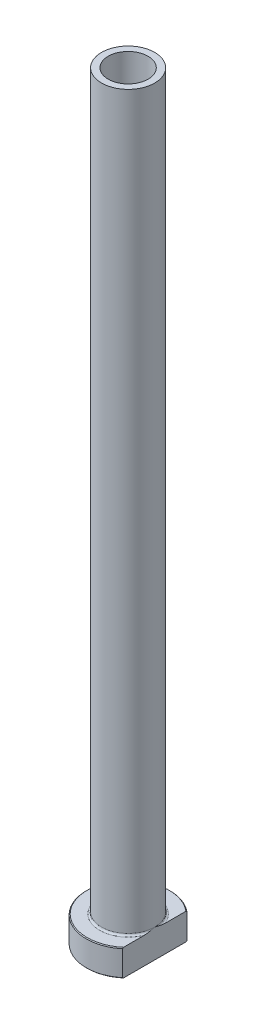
ISO-10303-21;
HEADER;
FILE_DESCRIPTION(('STEP AP214'),'2;1');
FILE_NAME('part.step','',(''),(''),'','','');
FILE_SCHEMA(('AUTOMOTIVE_DESIGN { 1 0 10303 214 1 1 1 1 }'));
ENDSEC;
DATA;
#1=APPLICATION_CONTEXT('core data for automotive mechanical design processes');
#2=APPLICATION_PROTOCOL_DEFINITION('international standard','automotive_design',2000,#1);
#3=PRODUCT_CONTEXT('',#1,'mechanical');
#4=PRODUCT('Part','Part','',(#3));
#5=PRODUCT_RELATED_PRODUCT_CATEGORY('part','',(#4));
#6=PRODUCT_DEFINITION_FORMATION('','',#4);
#7=PRODUCT_DEFINITION_CONTEXT('part definition',#1,'design');
#8=PRODUCT_DEFINITION('design','',#6,#7);
#9=PRODUCT_DEFINITION_SHAPE('','',#8);
#10=(LENGTH_UNIT() NAMED_UNIT(*) SI_UNIT(.MILLI.,.METRE.));
#11=(NAMED_UNIT(*) PLANE_ANGLE_UNIT() SI_UNIT($,.RADIAN.));
#12=(NAMED_UNIT(*) SI_UNIT($,.STERADIAN.) SOLID_ANGLE_UNIT());
#13=UNCERTAINTY_MEASURE_WITH_UNIT(LENGTH_MEASURE(1.E-05),#10,'distance_accuracy_value','');
#14=(GEOMETRIC_REPRESENTATION_CONTEXT(3) GLOBAL_UNCERTAINTY_ASSIGNED_CONTEXT((#13)) GLOBAL_UNIT_ASSIGNED_CONTEXT((#10,
#11,#12)) REPRESENTATION_CONTEXT('',''));
#15=CARTESIAN_POINT('',(0.,0.,0.));
#16=DIRECTION('',(0.,0.,1.));
#17=DIRECTION('',(1.,0.,0.));
#18=AXIS2_PLACEMENT_3D('',#15,#16,#17);
#19=CARTESIAN_POINT('',(0.,92.1876809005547,0.));
#20=DIRECTION('',(0.,1.,0.));
#21=DIRECTION('',(0.,0.,1.));
#22=AXIS2_PLACEMENT_3D('',#19,#20,#21);
#23=CYLINDRICAL_SURFACE('',#22,5.25);
#24=CARTESIAN_POINT('',(0.,200.,0.));
#25=DIRECTION('',(0.,1.,0.));
#26=DIRECTION('',(0.,0.,1.));
#27=AXIS2_PLACEMENT_3D('',#24,#25,#26);
#28=CIRCLE('',#27,5.25);
#29=CARTESIAN_POINT('',(0.,200.,5.25));
#30=VERTEX_POINT('',#29);
#31=EDGE_CURVE('E167',#30,#30,#28,.T.);
#32=ORIENTED_EDGE('',*,*,#31,.T.);
#33=EDGE_LOOP('',(#32));
#34=FACE_BOUND('',#33,.T.);
#35=CARTESIAN_POINT('',(0.,145.,0.));
#36=DIRECTION('',(0.,1.,0.));
#37=DIRECTION('',(0.,0.,1.));
#38=AXIS2_PLACEMENT_3D('',#35,#36,#37);
#39=CIRCLE('',#38,5.25);
#40=CARTESIAN_POINT('',(0.,145.,5.25));
#41=VERTEX_POINT('',#40);
#42=EDGE_CURVE('E170',#41,#41,#39,.T.);
#43=ORIENTED_EDGE('',*,*,#42,.F.);
#44=EDGE_LOOP('',(#43));
#45=FACE_BOUND('',#44,.T.);
#46=ADVANCED_FACE('F32',(#34,#45),#23,.F.);
#47=CARTESIAN_POINT('',(-5.25,200.,0.));
#48=DIRECTION('',(0.,1.,0.));
#49=DIRECTION('',(0.,0.,1.));
#50=AXIS2_PLACEMENT_3D('',#47,#48,#49);
#51=PLANE('',#50);
#52=CARTESIAN_POINT('',(0.,200.,0.));
#53=DIRECTION('',(0.,1.,0.));
#54=DIRECTION('',(0.,0.,1.));
#55=AXIS2_PLACEMENT_3D('',#52,#53,#54);
#56=CIRCLE('',#55,7.00000000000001);
#57=CARTESIAN_POINT('',(0.,200.,7.00000000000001));
#58=VERTEX_POINT('',#57);
#59=EDGE_CURVE('E174',#58,#58,#56,.T.);
#60=ORIENTED_EDGE('',*,*,#59,.T.);
#61=EDGE_LOOP('',(#60));
#62=FACE_BOUND('',#61,.T.);
#63=ORIENTED_EDGE('',*,*,#31,.F.);
#64=EDGE_LOOP('',(#63));
#65=FACE_BOUND('',#64,.T.);
#66=ADVANCED_FACE('F157',(#62,#65),#51,.T.);
#67=CARTESIAN_POINT('',(0.,92.1876809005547,0.));
#68=DIRECTION('',(0.,1.,0.));
#69=DIRECTION('',(0.,0.,1.));
#70=AXIS2_PLACEMENT_3D('',#67,#68,#69);
#71=CYLINDRICAL_SURFACE('',#70,7.);
#72=CARTESIAN_POINT('',(0.,7.50000000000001,0.));
#73=DIRECTION('',(0.,1.,0.));
#74=DIRECTION('',(0.,0.,1.));
#75=AXIS2_PLACEMENT_3D('',#72,#73,#74);
#76=CIRCLE('',#75,7.);
#77=CARTESIAN_POINT('',(7.,7.50000000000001,0.));
#78=VERTEX_POINT('',#77);
#79=EDGE_CURVE('E180',#78,#78,#76,.T.);
#80=ORIENTED_EDGE('',*,*,#79,.T.);
#81=EDGE_LOOP('',(#80));
#82=FACE_BOUND('',#81,.T.);
#83=ORIENTED_EDGE('',*,*,#59,.F.);
#84=EDGE_LOOP('',(#83));
#85=FACE_BOUND('',#84,.T.);
#86=ADVANCED_FACE('F162',(#82,#85),#71,.T.);
#87=CARTESIAN_POINT('',(-6.99999999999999,7.,0.));
#88=DIRECTION('',(0.,1.,0.));
#89=DIRECTION('',(0.,0.,1.));
#90=AXIS2_PLACEMENT_3D('',#87,#88,#89);
#91=PLANE('',#90);
#92=DIRECTION('',(0.,0.,1.));
#93=VECTOR('',#92,1.);
#94=CARTESIAN_POINT('',(6.99999999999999,7.,0.));
#95=LINE('',#94,#93);
#96=CARTESIAN_POINT('',(7.,7.,-8.22435407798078));
#97=VERTEX_POINT('',#96);
#98=CARTESIAN_POINT('',(6.99999999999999,7.,-2.69258240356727));
#99=VERTEX_POINT('',#98);
#100=EDGE_CURVE('E54',#97,#99,#95,.T.);
#101=ORIENTED_EDGE('',*,*,#100,.F.);
#102=CARTESIAN_POINT('',(0.,7.,0.));
#103=DIRECTION('',(0.,1.,0.));
#104=DIRECTION('',(0.,0.,1.));
#105=AXIS2_PLACEMENT_3D('',#102,#103,#104);
#106=CIRCLE('',#105,10.8);
#107=CARTESIAN_POINT('',(6.99999999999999,7.,8.22435407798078));
#108=VERTEX_POINT('',#107);
#109=EDGE_CURVE('E186',#97,#108,#106,.T.);
#110=ORIENTED_EDGE('',*,*,#109,.T.);
#111=CARTESIAN_POINT('',(6.99999999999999,7.,2.69258240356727));
#112=VERTEX_POINT('',#111);
#113=EDGE_CURVE('E134',#112,#108,#95,.T.);
#114=ORIENTED_EDGE('',*,*,#113,.F.);
#115=CARTESIAN_POINT('',(0.,7.,0.));
#116=DIRECTION('',(0.,1.,0.));
#117=DIRECTION('',(0.,0.,1.));
#118=AXIS2_PLACEMENT_3D('',#115,#116,#117);
#119=CIRCLE('',#118,7.5);
#120=EDGE_CURVE('E183',#112,#99,#119,.F.);
#121=ORIENTED_EDGE('',*,*,#120,.T.);
#122=EDGE_LOOP('',(#101,#110,#114,#121));
#123=FACE_BOUND('',#122,.T.);
#124=ADVANCED_FACE('F197',(#123),#91,.T.);
#125=CARTESIAN_POINT('',(0.,92.1876809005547,0.));
#126=DIRECTION('',(0.,1.,0.));
#127=DIRECTION('',(0.,0.,1.));
#128=AXIS2_PLACEMENT_3D('',#125,#126,#127);
#129=CYLINDRICAL_SURFACE('',#128,11.);
#130=DIRECTION('',(0.,-1.,0.));
#131=VECTOR('',#130,1.);
#132=CARTESIAN_POINT('',(6.99999999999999,200.,8.48528137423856));
#133=LINE('',#132,#131);
#134=CARTESIAN_POINT('',(6.99999999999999,6.79999999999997,8.48528137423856));
#135=VERTEX_POINT('',#134);
#136=CARTESIAN_POINT('',(6.99999999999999,0.200000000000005,8.48528137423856));
#137=VERTEX_POINT('',#136);
#138=EDGE_CURVE('E82',#135,#137,#133,.T.);
#139=ORIENTED_EDGE('',*,*,#138,.F.);
#140=CARTESIAN_POINT('',(0.,6.79999999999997,0.));
#141=DIRECTION('',(0.,1.,0.));
#142=DIRECTION('',(0.,0.,1.));
#143=AXIS2_PLACEMENT_3D('',#140,#141,#142);
#144=CIRCLE('',#143,11.);
#145=CARTESIAN_POINT('',(7.,6.79999999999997,-8.48528137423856));
#146=VERTEX_POINT('',#145);
#147=EDGE_CURVE('E95',#135,#146,#144,.F.);
#148=ORIENTED_EDGE('',*,*,#147,.T.);
#149=DIRECTION('',(0.,-1.,0.));
#150=VECTOR('',#149,1.);
#151=CARTESIAN_POINT('',(7.,200.,-8.48528137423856));
#152=LINE('',#151,#150);
#153=CARTESIAN_POINT('',(7.,0.200000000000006,-8.48528137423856));
#154=VERTEX_POINT('',#153);
#155=EDGE_CURVE('E192',#146,#154,#152,.T.);
#156=ORIENTED_EDGE('',*,*,#155,.T.);
#157=CARTESIAN_POINT('',(0.,0.200000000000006,0.));
#158=DIRECTION('',(0.,-1.,0.));
#159=DIRECTION('',(0.,0.,-1.));
#160=AXIS2_PLACEMENT_3D('',#157,#158,#159);
#161=CIRCLE('',#160,11.);
#162=EDGE_CURVE('E98',#154,#137,#161,.F.);
#163=ORIENTED_EDGE('',*,*,#162,.T.);
#164=EDGE_LOOP('',(#139,#148,#156,#163));
#165=FACE_BOUND('',#164,.T.);
#166=ADVANCED_FACE('F190',(#165),#129,.T.);
#167=CARTESIAN_POINT('',(-11.,0.,0.));
#168=DIRECTION('',(0.,-1.,0.));
#169=DIRECTION('',(0.,0.,-1.));
#170=AXIS2_PLACEMENT_3D('',#167,#168,#169);
#171=PLANE('',#170);
#172=CARTESIAN_POINT('',(0.,0.,0.));
#173=DIRECTION('',(0.,-1.,0.));
#174=DIRECTION('',(0.,0.,-1.));
#175=AXIS2_PLACEMENT_3D('',#172,#173,#174);
#176=CIRCLE('',#175,6.00000000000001);
#177=CARTESIAN_POINT('',(0.,0.,-6.00000000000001));
#178=VERTEX_POINT('',#177);
#179=EDGE_CURVE('E40',#178,#178,#176,.F.);
#180=ORIENTED_EDGE('',*,*,#179,.T.);
#181=EDGE_LOOP('',(#180));
#182=FACE_BOUND('',#181,.T.);
#183=DIRECTION('',(0.,0.,-1.));
#184=VECTOR('',#183,1.);
#185=CARTESIAN_POINT('',(6.99999999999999,0.,8.48528137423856));
#186=LINE('',#185,#184);
#187=CARTESIAN_POINT('',(6.99999999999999,0.,8.22435407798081));
#188=VERTEX_POINT('',#187);
#189=CARTESIAN_POINT('',(7.,0.,-8.22435407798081));
#190=VERTEX_POINT('',#189);
#191=EDGE_CURVE('E47',#188,#190,#186,.T.);
#192=ORIENTED_EDGE('',*,*,#191,.F.);
#193=CARTESIAN_POINT('',(0.,0.,0.));
#194=DIRECTION('',(0.,-1.,0.));
#195=DIRECTION('',(0.,0.,-1.));
#196=AXIS2_PLACEMENT_3D('',#193,#194,#195);
#197=CIRCLE('',#196,10.8);
#198=EDGE_CURVE('E92',#188,#190,#197,.T.);
#199=ORIENTED_EDGE('',*,*,#198,.T.);
#200=EDGE_LOOP('',(#192,#199));
#201=FACE_BOUND('',#200,.T.);
#202=ADVANCED_FACE('F91',(#182,#201),#171,.T.);
#203=CARTESIAN_POINT('',(0.,92.1876809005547,0.));
#204=DIRECTION('',(0.,1.,0.));
#205=DIRECTION('',(0.,0.,1.));
#206=AXIS2_PLACEMENT_3D('',#203,#204,#205);
#207=CYLINDRICAL_SURFACE('',#206,5.5);
#208=CARTESIAN_POINT('',(0.,0.500000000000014,0.));
#209=DIRECTION('',(0.,-1.,0.));
#210=DIRECTION('',(0.,0.,-1.));
#211=AXIS2_PLACEMENT_3D('',#208,#209,#210);
#212=CIRCLE('',#211,5.5);
#213=CARTESIAN_POINT('',(0.,0.500000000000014,-5.5));
#214=VERTEX_POINT('',#213);
#215=EDGE_CURVE('E11',#214,#214,#212,.T.);
#216=ORIENTED_EDGE('',*,*,#215,.T.);
#217=EDGE_LOOP('',(#216));
#218=FACE_BOUND('',#217,.T.);
#219=CARTESIAN_POINT('',(0.,133.,0.));
#220=DIRECTION('',(0.,1.,0.));
#221=DIRECTION('',(0.,0.,1.));
#222=AXIS2_PLACEMENT_3D('',#219,#220,#221);
#223=CIRCLE('',#222,5.50000000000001);
#224=CARTESIAN_POINT('',(0.,133.,5.50000000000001));
#225=VERTEX_POINT('',#224);
#226=EDGE_CURVE('E172',#225,#225,#223,.T.);
#227=ORIENTED_EDGE('',*,*,#226,.T.);
#228=EDGE_LOOP('',(#227));
#229=FACE_BOUND('',#228,.T.);
#230=ADVANCED_FACE('F215',(#218,#229),#207,.F.);
#231=CARTESIAN_POINT('',(0.,133.,0.));
#232=DIRECTION('',(0.,-1.,0.));
#233=DIRECTION('',(0.,0.,-1.));
#234=AXIS2_PLACEMENT_3D('',#231,#232,#233);
#235=CONICAL_SURFACE('',#234,5.50000000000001,0.0208303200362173);
#236=ORIENTED_EDGE('',*,*,#42,.T.);
#237=EDGE_LOOP('',(#236));
#238=FACE_BOUND('',#237,.T.);
#239=ORIENTED_EDGE('',*,*,#226,.F.);
#240=EDGE_LOOP('',(#239));
#241=FACE_BOUND('',#240,.T.);
#242=ADVANCED_FACE('F111',(#238,#241),#235,.F.);
#243=CARTESIAN_POINT('',(0.,7.50000000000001,0.));
#244=DIRECTION('',(0.,1.,0.));
#245=DIRECTION('',(0.,0.,1.));
#246=AXIS2_PLACEMENT_3D('',#243,#244,#245);
#247=TOROIDAL_SURFACE('',#246,7.5,0.5);
#248=ORIENTED_EDGE('',*,*,#120,.F.);
#249=CARTESIAN_POINT('',(7.,7.50000000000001,0.));
#250=CARTESIAN_POINT('',(7.,7.50000080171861,-1.25567824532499E-10));
#251=CARTESIAN_POINT('',(7.,7.50000160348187,2.90220328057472E-07));
#252=CARTESIAN_POINT('',(7.,7.50000310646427,1.10846453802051E-06));
#253=CARTESIAN_POINT('',(7.,7.50000379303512,1.65470126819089E-06));
#254=CARTESIAN_POINT('',(7.,7.50000521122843,2.96102774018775E-06));
#255=CARTESIAN_POINT('',(7.,7.5000059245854,3.7420420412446E-06));
#256=CARTESIAN_POINT('',(7.,7.50000721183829,5.36891904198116E-06));
#257=CARTESIAN_POINT('',(7.,7.5000077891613,6.21226373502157E-06));
#258=CARTESIAN_POINT('',(7.,7.5000099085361,9.448897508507E-06));
#259=CARTESIAN_POINT('',(7.,7.50001133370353,1.19224919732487E-05));
#260=CARTESIAN_POINT('',(7.,7.50001370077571,1.68453055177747E-05));
#261=CARTESIAN_POINT('',(7.,7.50001467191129,1.92810868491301E-05));
#262=CARTESIAN_POINT('',(7.,7.50001870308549,2.95057535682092E-05));
#263=CARTESIAN_POINT('',(7.,7.50002167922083,3.7333383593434E-05));
#264=CARTESIAN_POINT('',(7.,7.50002610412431,5.21820430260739E-05));
#265=CARTESIAN_POINT('',(7.,7.50002771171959,5.91556029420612E-05));
#266=CARTESIAN_POINT('',(7.,7.50003935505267,0.000110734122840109));
#267=CARTESIAN_POINT('',(7.,7.5000481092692,0.000155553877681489));
#268=CARTESIAN_POINT('',(6.99999999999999,7.50008643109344,0.000332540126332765));
#269=CARTESIAN_POINT('',(6.99999999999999,7.50012307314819,0.000463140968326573));
#270=CARTESIAN_POINT('',(7.,7.50026565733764,0.000980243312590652));
#271=CARTESIAN_POINT('',(7.,7.50036696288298,0.00136762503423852));
#272=CARTESIAN_POINT('',(6.99999999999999,7.50077257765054,0.00290683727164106));
#273=CARTESIAN_POINT('',(6.99999999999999,7.50108269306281,0.00405753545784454));
#274=CARTESIAN_POINT('',(7.00000000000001,7.50237341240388,0.00885983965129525));
#275=CARTESIAN_POINT('',(7.,7.50334676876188,0.0125128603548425));
#276=CARTESIAN_POINT('',(6.99999999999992,7.51627189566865,0.061003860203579));
#277=CARTESIAN_POINT('',(6.99999999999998,7.52827280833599,0.105832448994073));
#278=CARTESIAN_POINT('',(7.00000000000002,7.55170994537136,0.193693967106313));
#279=CARTESIAN_POINT('',(7.,7.56314936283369,0.236726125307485));
#280=CARTESIAN_POINT('',(6.99999999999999,7.58740418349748,0.328321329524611));
#281=CARTESIAN_POINT('',(6.99999999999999,7.6002083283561,0.376887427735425));
#282=CARTESIAN_POINT('',(7.,7.62578161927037,0.474605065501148));
#283=CARTESIAN_POINT('',(7.,7.63854879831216,0.523757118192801));
#284=CARTESIAN_POINT('',(6.99999999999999,7.66904753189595,0.64236612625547));
#285=CARTESIAN_POINT('',(7.,7.6866596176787,0.711854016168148));
#286=CARTESIAN_POINT('',(7.,7.72074501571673,0.849103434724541));
#287=CARTESIAN_POINT('',(7.,7.73723627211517,0.916860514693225));
#288=CARTESIAN_POINT('',(7.,7.79038156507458,1.14104210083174));
#289=CARTESIAN_POINT('',(7.,7.82528973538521,1.29788860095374));
#290=CARTESIAN_POINT('',(7.,7.88862298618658,1.61471917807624));
#291=CARTESIAN_POINT('',(7.,7.91697354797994,1.77471883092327));
#292=CARTESIAN_POINT('',(7.,7.95258292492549,2.02253505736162));
#293=CARTESIAN_POINT('',(7.,7.96355251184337,2.10981398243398));
#294=CARTESIAN_POINT('',(7.,7.98165287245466,2.28476193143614));
#295=CARTESIAN_POINT('',(7.,7.98878459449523,2.37243085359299));
#296=CARTESIAN_POINT('',(7.,7.99822919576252,2.54760327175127));
#297=CARTESIAN_POINT('',(7.,8.00056589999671,2.63510541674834));
#298=CARTESIAN_POINT('',(7.,7.99919996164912,2.81004074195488));
#299=CARTESIAN_POINT('',(7.,7.99550272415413,2.89747391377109));
#300=CARTESIAN_POINT('',(7.,7.98391011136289,3.02882076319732));
#301=CARTESIAN_POINT('',(7.,7.97897237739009,3.07299684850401));
#302=CARTESIAN_POINT('',(7.,7.96665453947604,3.16105400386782));
#303=CARTESIAN_POINT('',(7.,7.95927246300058,3.20493480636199));
#304=CARTESIAN_POINT('',(7.,7.94168688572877,3.29163191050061));
#305=CARTESIAN_POINT('',(7.,7.93151559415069,3.33445462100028));
#306=CARTESIAN_POINT('',(7.,7.90768392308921,3.41909658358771));
#307=CARTESIAN_POINT('',(7.,7.89402748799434,3.46091691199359));
#308=CARTESIAN_POINT('',(7.,7.86214701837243,3.54331777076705));
#309=CARTESIAN_POINT('',(7.,7.84387618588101,3.58388050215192));
#310=CARTESIAN_POINT('',(7.,7.80145892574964,3.66184445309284));
#311=CARTESIAN_POINT('',(7.,7.77733569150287,3.69925738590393));
#312=CARTESIAN_POINT('',(7.,7.73714014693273,3.74836513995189));
#313=CARTESIAN_POINT('',(7.,7.72423208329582,3.76263695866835));
#314=CARTESIAN_POINT('',(7.,7.69673765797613,3.78951670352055));
#315=CARTESIAN_POINT('',(7.,7.68215013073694,3.80212346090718));
#316=CARTESIAN_POINT('',(7.,7.65099843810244,3.82514624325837));
#317=CARTESIAN_POINT('',(7.,7.63441049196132,3.83553078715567));
#318=CARTESIAN_POINT('',(7.,7.59955798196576,3.85294010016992));
#319=CARTESIAN_POINT('',(7.,7.58129885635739,3.85997533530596));
#320=CARTESIAN_POINT('',(7.,7.54906837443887,3.86837810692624));
#321=CARTESIAN_POINT('',(7.,7.53536870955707,3.87079233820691));
#322=CARTESIAN_POINT('',(7.,7.50775756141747,3.87325240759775));
#323=CARTESIAN_POINT('',(7.,7.49384618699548,3.87329942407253));
#324=CARTESIAN_POINT('',(7.,7.46623771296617,3.87102093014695));
#325=CARTESIAN_POINT('',(7.,7.45254041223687,3.8686978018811));
#326=CARTESIAN_POINT('',(7.,7.42569741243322,3.86188775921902));
#327=CARTESIAN_POINT('',(7.,7.41255212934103,3.85739924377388));
#328=CARTESIAN_POINT('',(7.,7.38259319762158,3.84468786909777));
#329=CARTESIAN_POINT('',(7.,7.36610215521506,3.83570823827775));
#330=CARTESIAN_POINT('',(7.,7.33476729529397,3.8152320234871));
#331=CARTESIAN_POINT('',(7.,7.3199273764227,3.80372966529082));
#332=CARTESIAN_POINT('',(7.,7.2837192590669,3.77170797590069));
#333=CARTESIAN_POINT('',(7.,7.2635627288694,3.74983059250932));
#334=CARTESIAN_POINT('',(7.,7.22671696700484,3.70338283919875));
#335=CARTESIAN_POINT('',(7.,7.21003361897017,3.67880800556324));
#336=CARTESIAN_POINT('',(7.,7.18026553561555,3.62921731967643));
#337=CARTESIAN_POINT('',(7.,7.16704475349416,3.60428175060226));
#338=CARTESIAN_POINT('',(7.,7.14275069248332,3.55337478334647));
#339=CARTESIAN_POINT('',(7.,7.13167947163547,3.52740242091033));
#340=CARTESIAN_POINT('',(7.,7.1010449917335,3.4480957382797));
#341=CARTESIAN_POINT('',(7.,7.08424174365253,3.39369851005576));
#342=CARTESIAN_POINT('',(7.,7.0543137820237,3.27667221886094));
#343=CARTESIAN_POINT('',(7.,7.04191718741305,3.21386807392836));
#344=CARTESIAN_POINT('',(7.,7.02234605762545,3.08735184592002));
#345=CARTESIAN_POINT('',(7.,7.01518234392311,3.02363815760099));
#346=CARTESIAN_POINT('',(7.,7.00517826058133,2.89779001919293));
#347=CARTESIAN_POINT('',(7.,7.00221627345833,2.83566460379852));
#348=CARTESIAN_POINT('',(7.,6.99952325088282,2.71160626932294));
#349=CARTESIAN_POINT('',(7.,6.99977918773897,2.64967358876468));
#350=CARTESIAN_POINT('',(7.,7.00377761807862,2.49407814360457));
#351=CARTESIAN_POINT('',(7.,7.00924384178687,2.40046113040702));
#352=CARTESIAN_POINT('',(7.,7.02494106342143,2.21367396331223));
#353=CARTESIAN_POINT('',(7.,7.03517106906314,2.12050372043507));
#354=CARTESIAN_POINT('',(7.,7.05969765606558,1.9324903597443));
#355=CARTESIAN_POINT('',(7.,7.07408383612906,1.83765914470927));
#356=CARTESIAN_POINT('',(7.,7.10603300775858,1.64829340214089));
#357=CARTESIAN_POINT('',(7.,7.12360402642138,1.55376025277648));
#358=CARTESIAN_POINT('',(7.,7.16806468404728,1.33086107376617));
#359=CARTESIAN_POINT('',(7.,7.19601783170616,1.2027089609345));
#360=CARTESIAN_POINT('',(7.,7.25475947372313,0.948586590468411));
#361=CARTESIAN_POINT('',(7.,7.28551257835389,0.822607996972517));
#362=CARTESIAN_POINT('',(7.,7.33123897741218,0.641334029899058));
#363=CARTESIAN_POINT('',(7.,7.34543722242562,0.585840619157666));
#364=CARTESIAN_POINT('',(6.99999999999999,7.3741824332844,0.474686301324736));
#365=CARTESIAN_POINT('',(6.99999999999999,7.38873064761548,0.419025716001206));
#366=CARTESIAN_POINT('',(7.,7.41873357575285,0.305011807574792));
#367=CARTESIAN_POINT('',(7.,7.43419762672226,0.246660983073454));
#368=CARTESIAN_POINT('',(6.99999999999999,7.46502361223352,0.130933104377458));
#369=CARTESIAN_POINT('',(6.99999999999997,7.48038319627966,0.0735554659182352));
#370=CARTESIAN_POINT('',(7.,7.49665455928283,0.0125077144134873));
#371=CARTESIAN_POINT('',(7.,7.49762931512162,0.00884956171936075));
#372=CARTESIAN_POINT('',(6.99999999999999,7.49892036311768,0.00404608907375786));
#373=CARTESIAN_POINT('',(6.99999999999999,7.49922940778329,0.00289935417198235));
#374=CARTESIAN_POINT('',(7.,7.49963371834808,0.00136508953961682));
#375=CARTESIAN_POINT('',(7.,7.4997347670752,0.000978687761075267));
#376=CARTESIAN_POINT('',(6.99999999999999,7.49987704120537,0.000462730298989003));
#377=CARTESIAN_POINT('',(6.99999999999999,7.49991363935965,0.000332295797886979));
#378=CARTESIAN_POINT('',(7.,7.4999519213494,0.000155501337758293));
#379=CARTESIAN_POINT('',(7.,7.49996067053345,0.000110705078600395));
#380=CARTESIAN_POINT('',(7.,7.49997230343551,5.91504880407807E-05));
#381=CARTESIAN_POINT('',(7.,7.49997390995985,5.21782486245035E-05));
#382=CARTESIAN_POINT('',(7.,7.49997833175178,3.73322829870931E-05));
#383=CARTESIAN_POINT('',(7.,7.49998130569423,2.95059561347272E-05));
#384=CARTESIAN_POINT('',(7.,7.49998533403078,1.92826360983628E-05));
#385=CARTESIAN_POINT('',(7.,7.49998630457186,1.68469535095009E-05));
#386=CARTESIAN_POINT('',(7.,7.49998867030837,1.19242382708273E-05));
#387=CARTESIAN_POINT('',(7.,7.49999009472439,9.45063129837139E-06));
#388=CARTESIAN_POINT('',(7.,7.49999221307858,6.21386495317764E-06));
#389=CARTESIAN_POINT('',(7.,7.4999927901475,5.37045357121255E-06));
#390=CARTESIAN_POINT('',(7.,7.49999407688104,3.74339732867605E-06));
#391=CARTESIAN_POINT('',(7.,7.49999478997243,2.96226892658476E-06));
#392=CARTESIAN_POINT('',(7.,7.49999620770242,1.65567368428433E-06));
#393=CARTESIAN_POINT('',(7.,7.4999968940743,1.10929212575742E-06));
#394=CARTESIAN_POINT('',(7.,7.49999839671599,2.90683261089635E-07));
#395=CARTESIAN_POINT('',(7.,7.49999919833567,1.25560755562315E-10));
#396=CARTESIAN_POINT('',(7.,7.50000000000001,0.));
#397=B_SPLINE_CURVE_WITH_KNOTS('',3,(#249,#250,#251,#252,#253,#254,#255,#256,#257,#258,#259,
#260,#261,#262,#263,#264,#265,#266,#267,#268,#269,#270,#271,#272,#273,#274,#275,#276,#277,#278,
#279,#280,#281,#282,#283,#284,#285,#286,#287,#288,#289,#290,#291,#292,#293,#294,#295,#296,#297,
#298,#299,#300,#301,#302,#303,#304,#305,#306,#307,#308,#309,#310,#311,#312,#313,#314,#315,#316,
#317,#318,#319,#320,#321,#322,#323,#324,#325,#326,#327,#328,#329,#330,#331,#332,#333,#334,#335,
#336,#337,#338,#339,#340,#341,#342,#343,#344,#345,#346,#347,#348,#349,#350,#351,#352,#353,#354,
#355,#356,#357,#358,#359,#360,#361,#362,#363,#364,#365,#366,#367,#368,#369,#370,#371,#372,#373,
#374,#375,#376,#377,#378,#379,#380,#381,#382,#383,#384,#385,#386,#387,#388,#389,#390,#391,#392,
#393,#394,#395,#396),.UNSPECIFIED.,.T.,.F.,(4,2,2,2,2,2,2,2,2,2,2,2,2,2,2,2,2,2,2,2,2,2,2,2,2,2,
2,2,2,2,2,2,2,2,2,2,2,2,2,2,2,2,2,2,2,2,2,2,2,2,2,2,2,2,2,2,2,2,2,2,2,2,2,2,2,2,2,2,2,2,2,2,2,
4),(0.,2.42201335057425E-06,5.05304708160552E-06,8.20813908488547E-06,1.12722906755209E-05,
1.98043989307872E-05,2.76642029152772E-05,5.27403813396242E-05,7.41830742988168E-05,
0.000211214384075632,0.000617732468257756,0.00181938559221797,0.00539412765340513,
0.0167361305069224,0.155952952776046,0.289534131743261,0.440210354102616,0.592559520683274,
0.807611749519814,1.01681499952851,1.49878389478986,1.98598665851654,2.24981935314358,
2.51358682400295,2.77604050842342,3.03825922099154,3.17156039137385,3.3049693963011,
3.4368983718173,3.56867869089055,3.70185328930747,3.83450849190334,3.89212877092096,
3.94978928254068,4.00821928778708,4.06646549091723,4.10801107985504,4.14953598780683,
4.19101920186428,4.2325331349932,4.2885486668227,4.34469377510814,4.43343413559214,
4.52232362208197,4.6068678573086,4.6914926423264,4.86185145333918,5.05362927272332,
5.24580256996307,5.43229132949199,5.6180253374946,5.89918385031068,6.18028382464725,
6.46796485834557,6.75638131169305,7.14981284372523,7.53882346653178,7.71066604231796,
7.88325629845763,8.06435328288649,8.24254095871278,8.25389891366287,8.25746134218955,
8.25865995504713,8.25906595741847,8.25920291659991,8.25922435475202,8.25924942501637,
8.25925728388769,8.25926581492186,8.25926887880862,8.25927203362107,8.25927466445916,
8.25927708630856),.UNSPECIFIED.);
#398=EDGE_CURVE('E126',#112,#78,#397,.T.);
#399=ORIENTED_EDGE('',*,*,#398,.T.);
#400=ORIENTED_EDGE('',*,*,#79,.F.);
#401=CARTESIAN_POINT('',(7.,7.50000000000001,0.));
#402=CARTESIAN_POINT('',(7.,7.49999919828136,1.25555894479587E-10));
#403=CARTESIAN_POINT('',(7.,7.49999839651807,-2.90220343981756E-07));
#404=CARTESIAN_POINT('',(7.,7.4999968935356,-1.10846456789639E-06));
#405=CARTESIAN_POINT('',(7.,7.49999620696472,-1.65470130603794E-06));
#406=CARTESIAN_POINT('',(7.,7.49999478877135,-2.96102779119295E-06));
#407=CARTESIAN_POINT('',(7.,7.49999407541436,-3.74204209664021E-06));
#408=CARTESIAN_POINT('',(7.,7.49999278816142,-5.36891911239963E-06));
#409=CARTESIAN_POINT('',(7.,7.49999221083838,-6.21226381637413E-06));
#410=CARTESIAN_POINT('',(7.,7.49999009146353,-9.44889759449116E-06));
#411=CARTESIAN_POINT('',(7.,7.49998866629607,-1.19224920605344E-05));
#412=CARTESIAN_POINT('',(7.,7.49998629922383,-1.68453056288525E-05));
#413=CARTESIAN_POINT('',(7.,7.49998532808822,-1.92810869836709E-05));
#414=CARTESIAN_POINT('',(7.,7.49998129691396,-2.95057536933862E-05));
#415=CARTESIAN_POINT('',(7.,7.49997832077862,-3.73333836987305E-05));
#416=CARTESIAN_POINT('',(7.,7.49997389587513,-5.21820431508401E-05));
#417=CARTESIAN_POINT('',(7.,7.49997228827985,-5.91556031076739E-05));
#418=CARTESIAN_POINT('',(7.,7.49996064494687,-0.000110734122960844));
#419=CARTESIAN_POINT('',(7.,7.49995189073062,-0.000155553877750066));
#420=CARTESIAN_POINT('',(6.99999999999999,7.49991356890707,-0.000332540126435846));
#421=CARTESIAN_POINT('',(6.99999999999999,7.49987692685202,-0.000463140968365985));
#422=CARTESIAN_POINT('',(7.,7.49973434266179,-0.000980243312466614));
#423=CARTESIAN_POINT('',(7.,7.4996330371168,-0.00136762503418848));
#424=CARTESIAN_POINT('',(6.99999999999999,7.49922742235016,-0.00290683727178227));
#425=CARTESIAN_POINT('',(6.99999999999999,7.49891730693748,-0.00405753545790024));
#426=CARTESIAN_POINT('',(7.,7.49762658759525,-0.00885983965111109));
#427=CARTESIAN_POINT('',(7.,7.49665323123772,-0.0125128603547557));
#428=CARTESIAN_POINT('',(6.99999999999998,7.4837281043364,-0.0610038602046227));
#429=CARTESIAN_POINT('',(6.99999999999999,7.47172719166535,-0.105832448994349));
#430=CARTESIAN_POINT('',(7.,7.44829005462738,-0.193693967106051));
#431=CARTESIAN_POINT('',(7.,7.43685063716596,-0.236726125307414));
#432=CARTESIAN_POINT('',(6.99999999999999,7.41259581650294,-0.328321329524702));
#433=CARTESIAN_POINT('',(7.,7.39979167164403,-0.376887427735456));
#434=CARTESIAN_POINT('',(7.,7.37421838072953,-0.474605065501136));
#435=CARTESIAN_POINT('',(7.,7.36145120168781,-0.523757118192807));
#436=CARTESIAN_POINT('',(7.,7.3309524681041,-0.642366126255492));
#437=CARTESIAN_POINT('',(7.,7.31334038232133,-0.71185401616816));
#438=CARTESIAN_POINT('',(7.,7.27925498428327,-0.849103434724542));
#439=CARTESIAN_POINT('',(7.,7.26276372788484,-0.916860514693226));
#440=CARTESIAN_POINT('',(7.,7.20961843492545,-1.14104210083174));
#441=CARTESIAN_POINT('',(7.,7.17471026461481,-1.29788860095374));
#442=CARTESIAN_POINT('',(7.,7.11137701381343,-1.61471917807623));
#443=CARTESIAN_POINT('',(7.,7.08302645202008,-1.77471883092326));
#444=CARTESIAN_POINT('',(7.,7.04741707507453,-2.02253505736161));
#445=CARTESIAN_POINT('',(7.,7.03644748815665,-2.10981398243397));
#446=CARTESIAN_POINT('',(7.,7.01834712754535,-2.28476193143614));
#447=CARTESIAN_POINT('',(7.,7.01121540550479,-2.37243085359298));
#448=CARTESIAN_POINT('',(7.,7.00177080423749,-2.54760327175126));
#449=CARTESIAN_POINT('',(7.,6.9994341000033,-2.63510541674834));
#450=CARTESIAN_POINT('',(7.,7.00080003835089,-2.81004074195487));
#451=CARTESIAN_POINT('',(7.,7.00449727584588,-2.89747391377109));
#452=CARTESIAN_POINT('',(7.,7.01608988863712,-3.02882076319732));
#453=CARTESIAN_POINT('',(7.,7.02102762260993,-3.072996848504));
#454=CARTESIAN_POINT('',(7.,7.03334546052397,-3.16105400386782));
#455=CARTESIAN_POINT('',(7.,7.04072753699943,-3.20493480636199));
#456=CARTESIAN_POINT('',(7.,7.05831311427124,-3.29163191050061));
#457=CARTESIAN_POINT('',(7.,7.06848440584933,-3.33445462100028));
#458=CARTESIAN_POINT('',(7.,7.09231607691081,-3.41909658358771));
#459=CARTESIAN_POINT('',(7.,7.10597251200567,-3.46091691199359));
#460=CARTESIAN_POINT('',(7.,7.13785298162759,-3.54331777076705));
#461=CARTESIAN_POINT('',(7.,7.156123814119,-3.58388050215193));
#462=CARTESIAN_POINT('',(7.,7.19854107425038,-3.66184445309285));
#463=CARTESIAN_POINT('',(7.,7.22266430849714,-3.69925738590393));
#464=CARTESIAN_POINT('',(7.,7.26285985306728,-3.74836513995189));
#465=CARTESIAN_POINT('',(7.,7.27576791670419,-3.76263695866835));
#466=CARTESIAN_POINT('',(7.,7.30326234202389,-3.78951670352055));
#467=CARTESIAN_POINT('',(7.,7.31784986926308,-3.80212346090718));
#468=CARTESIAN_POINT('',(7.,7.34900156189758,-3.82514624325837));
#469=CARTESIAN_POINT('',(7.,7.36558950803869,-3.83553078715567));
#470=CARTESIAN_POINT('',(7.,7.40044201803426,-3.85294010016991));
#471=CARTESIAN_POINT('',(7.,7.41870114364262,-3.85997533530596));
#472=CARTESIAN_POINT('',(7.,7.45093162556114,-3.86837810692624));
#473=CARTESIAN_POINT('',(7.,7.46463129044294,-3.87079233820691));
#474=CARTESIAN_POINT('',(7.,7.49224243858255,-3.87325240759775));
#475=CARTESIAN_POINT('',(7.,7.50615381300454,-3.87329942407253));
#476=CARTESIAN_POINT('',(7.,7.53376228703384,-3.87102093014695));
#477=CARTESIAN_POINT('',(7.,7.54745958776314,-3.8686978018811));
#478=CARTESIAN_POINT('',(7.,7.57430258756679,-3.86188775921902));
#479=CARTESIAN_POINT('',(7.,7.58744787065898,-3.85739924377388));
#480=CARTESIAN_POINT('',(7.,7.61740680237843,-3.84468786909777));
#481=CARTESIAN_POINT('',(7.,7.63389784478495,-3.83570823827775));
#482=CARTESIAN_POINT('',(7.,7.66523270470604,-3.8152320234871));
#483=CARTESIAN_POINT('',(7.,7.68007262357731,-3.80372966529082));
#484=CARTESIAN_POINT('',(7.,7.71628074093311,-3.77170797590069));
#485=CARTESIAN_POINT('',(7.,7.73643727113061,-3.74983059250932));
#486=CARTESIAN_POINT('',(7.,7.77328303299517,-3.70338283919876));
#487=CARTESIAN_POINT('',(7.,7.78996638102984,-3.67880800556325));
#488=CARTESIAN_POINT('',(7.,7.81973446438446,-3.62921731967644));
#489=CARTESIAN_POINT('',(7.,7.83295524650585,-3.60428175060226));
#490=CARTESIAN_POINT('',(7.,7.85724930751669,-3.55337478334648));
#491=CARTESIAN_POINT('',(7.,7.86832052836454,-3.52740242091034));
#492=CARTESIAN_POINT('',(7.,7.89895500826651,-3.44809573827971));
#493=CARTESIAN_POINT('',(7.,7.91575825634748,-3.39369851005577));
#494=CARTESIAN_POINT('',(7.,7.94568621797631,-3.27667221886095));
#495=CARTESIAN_POINT('',(7.,7.95808281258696,-3.21386807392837));
#496=CARTESIAN_POINT('',(7.,7.97765394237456,-3.08735184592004));
#497=CARTESIAN_POINT('',(7.,7.98481765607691,-3.023638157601));
#498=CARTESIAN_POINT('',(7.,7.99482173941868,-2.89779001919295));
#499=CARTESIAN_POINT('',(7.,7.99778372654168,-2.83566460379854));
#500=CARTESIAN_POINT('',(7.,8.00047674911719,-2.71160626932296));
#501=CARTESIAN_POINT('',(7.,8.00022081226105,-2.6496735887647));
#502=CARTESIAN_POINT('',(7.,7.99622238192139,-2.49407814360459));
#503=CARTESIAN_POINT('',(7.,7.99075615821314,-2.40046113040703));
#504=CARTESIAN_POINT('',(7.,7.97505893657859,-2.21367396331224));
#505=CARTESIAN_POINT('',(7.,7.96482893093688,-2.12050372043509));
#506=CARTESIAN_POINT('',(7.,7.94030234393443,-1.93249035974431));
#507=CARTESIAN_POINT('',(7.,7.92591616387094,-1.83765914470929));
#508=CARTESIAN_POINT('',(7.,7.89396699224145,-1.64829340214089));
#509=CARTESIAN_POINT('',(7.,7.87639597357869,-1.55376025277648));
#510=CARTESIAN_POINT('',(7.,7.83193531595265,-1.3308610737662));
#511=CARTESIAN_POINT('',(7.,7.8039821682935,-1.2027089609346));
#512=CARTESIAN_POINT('',(7.,7.74524052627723,-0.948586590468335));
#513=CARTESIAN_POINT('',(7.,7.71448742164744,-0.822607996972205));
#514=CARTESIAN_POINT('',(7.,7.66876102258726,-0.641334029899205));
#515=CARTESIAN_POINT('',(7.,7.65456277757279,-0.58584061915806));
#516=CARTESIAN_POINT('',(6.99999999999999,7.62581756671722,-0.474686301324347));
#517=CARTESIAN_POINT('',(6.99999999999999,7.61126935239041,-0.41902571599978));
#518=CARTESIAN_POINT('',(7.,7.58126642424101,-0.30501180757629));
#519=CARTESIAN_POINT('',(7.,7.56580237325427,-0.246660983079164));
#520=CARTESIAN_POINT('',(6.99999999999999,7.5349763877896,-0.13093310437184));
#521=CARTESIAN_POINT('',(6.99999999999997,7.51961680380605,-0.0735554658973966));
#522=CARTESIAN_POINT('',(7.,7.50334544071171,-0.0125077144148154));
#523=CARTESIAN_POINT('',(7.,7.50237068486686,-0.00884956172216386));
#524=CARTESIAN_POINT('',(6.99999999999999,7.50107963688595,-0.00404608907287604));
#525=CARTESIAN_POINT('',(6.99999999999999,7.50077059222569,-0.00289935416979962));
#526=CARTESIAN_POINT('',(7.,7.50036628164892,-0.00136508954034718));
#527=CARTESIAN_POINT('',(7.,7.50026523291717,-0.000978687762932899));
#528=CARTESIAN_POINT('',(6.99999999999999,7.50012295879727,-0.000462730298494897));
#529=CARTESIAN_POINT('',(6.99999999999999,7.50008636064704,-0.000332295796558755));
#530=CARTESIAN_POINT('',(7.,7.50004807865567,-0.000155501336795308));
#531=CARTESIAN_POINT('',(7.,7.50003932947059,-0.000110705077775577));
#532=CARTESIAN_POINT('',(7.,7.50002769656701,-5.91504874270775E-05));
#533=CARTESIAN_POINT('',(7.,7.50002609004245,-5.21782480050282E-05));
#534=CARTESIAN_POINT('',(7.,7.50002166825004,-3.7332282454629E-05));
#535=CARTESIAN_POINT('',(7.,7.50001869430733,-2.95059556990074E-05));
#536=CARTESIAN_POINT('',(7.,7.50001466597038,-1.92826357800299E-05));
#537=CARTESIAN_POINT('',(7.,7.50001369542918,-1.68469531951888E-05));
#538=CARTESIAN_POINT('',(7.,7.50001132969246,-1.19242380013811E-05));
#539=CARTESIAN_POINT('',(7.,7.50000990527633,-9.45063106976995E-06));
#540=CARTESIAN_POINT('',(7.,7.50000778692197,-6.21386478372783E-06));
#541=CARTESIAN_POINT('',(7.,7.500007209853,-5.37045340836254E-06));
#542=CARTESIAN_POINT('',(7.,7.50000592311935,-3.7433971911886E-06));
#543=CARTESIAN_POINT('',(7.,7.50000521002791,-2.96226880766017E-06));
#544=CARTESIAN_POINT('',(7.,7.50000379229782,-1.655673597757E-06));
#545=CARTESIAN_POINT('',(7.,7.50000310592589,-1.10929205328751E-06));
#546=CARTESIAN_POINT('',(7.,7.50000160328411,-2.9068322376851E-07));
#547=CARTESIAN_POINT('',(7.,7.50000080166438,-1.25545964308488E-10));
#548=CARTESIAN_POINT('',(7.,7.50000000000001,0.));
#549=B_SPLINE_CURVE_WITH_KNOTS('',3,(#401,#402,#403,#404,#405,#406,#407,#408,#409,#410,#411,
#412,#413,#414,#415,#416,#417,#418,#419,#420,#421,#422,#423,#424,#425,#426,#427,#428,#429,#430,
#431,#432,#433,#434,#435,#436,#437,#438,#439,#440,#441,#442,#443,#444,#445,#446,#447,#448,#449,
#450,#451,#452,#453,#454,#455,#456,#457,#458,#459,#460,#461,#462,#463,#464,#465,#466,#467,#468,
#469,#470,#471,#472,#473,#474,#475,#476,#477,#478,#479,#480,#481,#482,#483,#484,#485,#486,#487,
#488,#489,#490,#491,#492,#493,#494,#495,#496,#497,#498,#499,#500,#501,#502,#503,#504,#505,#506,
#507,#508,#509,#510,#511,#512,#513,#514,#515,#516,#517,#518,#519,#520,#521,#522,#523,#524,#525,
#526,#527,#528,#529,#530,#531,#532,#533,#534,#535,#536,#537,#538,#539,#540,#541,#542,#543,#544,
#545,#546,#547,#548),.UNSPECIFIED.,.T.,.F.,(4,2,2,2,2,2,2,2,2,2,2,2,2,2,2,2,2,2,2,2,2,2,2,2,2,2,
2,2,2,2,2,2,2,2,2,2,2,2,2,2,2,2,2,2,2,2,2,2,2,2,2,2,2,2,2,2,2,2,2,2,2,2,2,2,2,2,2,2,2,2,2,2,2,
4),(0.,2.4220134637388E-06,5.05304728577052E-06,8.2081393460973E-06,1.12722910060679E-05,
1.98043993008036E-05,2.7664203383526E-05,5.27403817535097E-05,7.4183074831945E-05,
0.000211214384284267,0.000617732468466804,0.00181938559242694,0.00539412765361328,
0.0167361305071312,0.155952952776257,0.289534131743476,0.440210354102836,0.592559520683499,
0.807611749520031,1.01681499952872,1.49878389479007,1.98598665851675,2.24981935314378,
2.51358682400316,2.77604050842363,3.03825922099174,3.17156039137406,3.30496939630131,
3.43689837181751,3.56867869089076,3.70185328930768,3.83450849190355,3.89212877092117,
3.94978928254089,4.00821928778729,4.06646549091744,4.10801107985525,4.14953598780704,
4.19101920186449,4.2325331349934,4.28854866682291,4.34469377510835,4.43343413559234,
4.52232362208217,4.60686785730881,4.6914926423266,4.86185145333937,5.05362927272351,
5.24580256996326,5.43229132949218,5.61802533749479,5.89918385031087,6.18028382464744,
6.46796485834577,6.75638131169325,7.14981284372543,7.53882346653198,7.71066604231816,
7.88325629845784,8.0643532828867,8.24254095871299,8.25389891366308,8.25746134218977,
8.25865995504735,8.25906595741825,8.25920291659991,8.25922435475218,8.25924942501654,
8.25925728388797,8.25926581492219,8.25926887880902,8.25927203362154,8.25927466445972,
8.25927708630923),.UNSPECIFIED.);
#550=EDGE_CURVE('E135',#78,#99,#549,.T.);
#551=ORIENTED_EDGE('',*,*,#550,.T.);
#552=EDGE_LOOP('',(#248,#399,#400,#551));
#553=FACE_BOUND('',#552,.T.);
#554=ADVANCED_FACE('F141',(#553),#247,.F.);
#555=CARTESIAN_POINT('',(0.,7.00000000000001,0.));
#556=DIRECTION('',(0.,-1.,0.));
#557=DIRECTION('',(0.,0.,-1.));
#558=AXIS2_PLACEMENT_3D('',#555,#556,#557);
#559=CONICAL_SURFACE('',#558,10.7999999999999,0.785398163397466);
#560=CARTESIAN_POINT('',(7.,-2.13774979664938,-18.6685261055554));
#561=CARTESIAN_POINT('',(7.,-1.86574872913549,-18.3780244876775));
#562=CARTESIAN_POINT('',(7.,-1.59415659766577,-18.0871392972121));
#563=CARTESIAN_POINT('',(7.,-1.05192877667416,-17.5044755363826));
#564=CARTESIAN_POINT('',(7.,-0.781293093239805,-17.2126969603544));
#565=CARTESIAN_POINT('',(7.,-0.241050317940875,-16.628048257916));
#566=CARTESIAN_POINT('',(7.,0.028556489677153,-16.3351778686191));
#567=CARTESIAN_POINT('',(7.,0.566485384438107,-15.7482616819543));
#568=CARTESIAN_POINT('',(7.,0.834807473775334,-15.4542158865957));
#569=CARTESIAN_POINT('',(7.,1.64198377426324,-14.5651645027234));
#570=CARTESIAN_POINT('',(7.,2.17856420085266,-13.9680841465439));
#571=CARTESIAN_POINT('',(7.,2.97696333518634,-13.0668144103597));
#572=CARTESIAN_POINT('',(7.,3.24199785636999,-12.7654727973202));
#573=CARTESIAN_POINT('',(7.,3.76945856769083,-12.1605141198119));
#574=CARTESIAN_POINT('',(7.,4.03188476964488,-11.8568970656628));
#575=CARTESIAN_POINT('',(7.,4.50733797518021,-11.3009625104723));
#576=CARTESIAN_POINT('',(7.,4.72088020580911,-11.0490858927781));
#577=CARTESIAN_POINT('',(7.,5.14538078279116,-10.543165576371));
#578=CARTESIAN_POINT('',(7.,5.35633915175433,-10.2891218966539));
#579=CARTESIAN_POINT('',(7.,5.77522964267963,-9.77836737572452));
#580=CARTESIAN_POINT('',(7.,5.98316044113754,-9.52165544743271));
#581=CARTESIAN_POINT('',(7.,6.39521098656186,-9.00519084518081));
#582=CARTESIAN_POINT('',(7.,6.59933078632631,-8.74543821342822));
#583=CARTESIAN_POINT('',(7.,7.0024344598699,-8.22283607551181));
#584=CARTESIAN_POINT('',(7.,7.20142819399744,-7.95999419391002));
#585=CARTESIAN_POINT('',(7.,7.5935384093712,-7.42991856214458));
#586=CARTESIAN_POINT('',(7.,7.78665447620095,-7.16268450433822));
#587=CARTESIAN_POINT('',(7.,8.16523718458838,-6.62311113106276));
#588=CARTESIAN_POINT('',(7.,8.35070911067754,-6.35077553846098));
#589=CARTESIAN_POINT('',(7.,8.71189725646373,-5.79973731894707));
#590=CARTESIAN_POINT('',(7.,8.88761537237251,-5.52103594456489));
#591=CARTESIAN_POINT('',(7.,9.19554959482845,-5.00707921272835));
#592=CARTESIAN_POINT('',(7.,9.32988075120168,-4.77309669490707));
#593=CARTESIAN_POINT('',(7.,9.58764253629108,-4.29911523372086));
#594=CARTESIAN_POINT('',(7.,9.71107181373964,-4.05911554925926));
#595=CARTESIAN_POINT('',(7.,9.94390907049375,-3.57263619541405));
#596=CARTESIAN_POINT('',(7.,10.0533307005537,-3.3261631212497));
#597=CARTESIAN_POINT('',(7.,10.2545146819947,-2.82607166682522));
#598=CARTESIAN_POINT('',(7.,10.346282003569,-2.57245532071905));
#599=CARTESIAN_POINT('',(7.,10.4907049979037,-2.1125444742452));
#600=CARTESIAN_POINT('',(7.,10.5475277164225,-1.9075661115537));
#601=CARTESIAN_POINT('',(7.,10.6452043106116,-1.49381161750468));
#602=CARTESIAN_POINT('',(7.,10.68606033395,-1.28503600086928));
#603=CARTESIAN_POINT('',(7.,10.7497550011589,-0.86534251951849));
#604=CARTESIAN_POINT('',(7.,10.7726462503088,-0.654432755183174));
#605=CARTESIAN_POINT('',(7.,10.7993569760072,-0.231396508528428));
#606=CARTESIAN_POINT('',(7.,10.8031771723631,-0.0192700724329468));
#607=CARTESIAN_POINT('',(7.,10.7915178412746,0.404715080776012));
#608=CARTESIAN_POINT('',(7.,10.7760135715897,0.616573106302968));
#609=CARTESIAN_POINT('',(7.,10.7265413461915,1.03810446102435));
#610=CARTESIAN_POINT('',(7.,10.6925718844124,1.24777761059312));
#611=CARTESIAN_POINT('',(7.,10.6077703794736,1.66430273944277));
#612=CARTESIAN_POINT('',(7.,10.5568873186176,1.87114418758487));
#613=CARTESIAN_POINT('',(7.,10.4404729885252,2.28061279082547));
#614=CARTESIAN_POINT('',(7.,10.3749414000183,2.48323985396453));
#615=CARTESIAN_POINT('',(7.,10.2190980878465,2.91860265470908));
#616=CARTESIAN_POINT('',(7.,10.1264616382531,3.15050038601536));
#617=CARTESIAN_POINT('',(7.,9.9274095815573,3.60835455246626));
#618=CARTESIAN_POINT('',(7.,9.82098769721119,3.83430822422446));
#619=CARTESIAN_POINT('',(7.,9.59695142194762,4.28105341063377));
#620=CARTESIAN_POINT('',(6.99999999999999,9.47931762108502,4.50183511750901));
#621=CARTESIAN_POINT('',(6.99999999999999,9.23524231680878,4.93840249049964));
#622=CARTESIAN_POINT('',(6.99999999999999,9.10880204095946,5.15418884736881));
#623=CARTESIAN_POINT('',(6.99999999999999,8.84714657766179,5.5841794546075));
#624=CARTESIAN_POINT('',(6.99999999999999,8.71183920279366,5.79832734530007));
#625=CARTESIAN_POINT('',(6.99999999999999,8.43533082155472,6.22277635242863));
#626=CARTESIAN_POINT('',(6.99999999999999,8.29412966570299,6.4330773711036));
#627=CARTESIAN_POINT('',(6.99999999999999,8.007065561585,6.85014007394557));
#628=CARTESIAN_POINT('',(6.99999999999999,7.86120763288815,7.05690522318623));
#629=CARTESIAN_POINT('',(6.99999999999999,7.56553131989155,7.46757278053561));
#630=CARTESIAN_POINT('',(6.99999999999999,7.41571298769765,7.67147522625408));
#631=CARTESIAN_POINT('',(6.99999999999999,7.07999705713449,8.12067189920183));
#632=CARTESIAN_POINT('',(6.99999999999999,6.89330819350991,8.36537403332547));
#633=CARTESIAN_POINT('',(6.99999999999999,6.51597189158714,8.85171196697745));
#634=CARTESIAN_POINT('',(6.99999999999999,6.32532432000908,9.09334766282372));
#635=CARTESIAN_POINT('',(6.99999999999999,5.94076020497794,9.57404667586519));
#636=CARTESIAN_POINT('',(6.99999999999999,5.74684327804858,9.81310968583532));
#637=CARTESIAN_POINT('',(6.99999999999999,5.35630729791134,10.2890203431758));
#638=CARTESIAN_POINT('',(6.99999999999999,5.15968820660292,10.5258679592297));
#639=CARTESIAN_POINT('',(6.99999999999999,4.5660695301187,11.2340330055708));
#640=CARTESIAN_POINT('',(6.99999999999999,4.16568148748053,11.7025100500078));
#641=CARTESIAN_POINT('',(6.99999999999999,3.3584003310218,12.633824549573));
#642=CARTESIAN_POINT('',(6.99999999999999,2.95150704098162,13.0966618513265));
#643=CARTESIAN_POINT('',(6.99999999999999,2.35017562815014,13.7734103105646));
#644=CARTESIAN_POINT('',(6.99999999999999,2.15763812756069,13.9890143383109));
#645=CARTESIAN_POINT('',(6.99999999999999,1.77161609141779,14.4193671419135));
#646=CARTESIAN_POINT('',(6.99999999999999,1.57813157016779,14.6341159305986));
#647=CARTESIAN_POINT('',(6.99999999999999,0.99641244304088,15.2772388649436));
#648=CARTESIAN_POINT('',(6.99999999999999,0.606922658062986,15.7044779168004));
#649=CARTESIAN_POINT('',(6.99999999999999,-0.173895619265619,16.5556520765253));
#650=CARTESIAN_POINT('',(6.99999999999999,-0.565218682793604,16.9795921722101));
#651=CARTESIAN_POINT('',(6.99999999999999,-1.34999931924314,17.8254589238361));
#652=CARTESIAN_POINT('',(6.99999999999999,-1.74345679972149,18.2473856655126));
#653=CARTESIAN_POINT('',(6.99999999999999,-2.13774979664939,18.6685261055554));
#654=B_SPLINE_CURVE_WITH_KNOTS('',3,(#560,#561,#562,#563,#564,#565,#566,#567,#568,#569,#570,
#571,#572,#573,#574,#575,#576,#577,#578,#579,#580,#581,#582,#583,#584,#585,#586,#587,#588,#589,
#590,#591,#592,#593,#594,#595,#596,#597,#598,#599,#600,#601,#602,#603,#604,#605,#606,#607,#608,
#609,#610,#611,#612,#613,#614,#615,#616,#617,#618,#619,#620,#621,#622,#623,#624,#625,#626,#627,
#628,#629,#630,#631,#632,#633,#634,#635,#636,#637,#638,#639,#640,#641,#642,#643,#644,#645,#646,
#647,#648,#649,#650,#651,#652,#653),.UNSPECIFIED.,.F.,.F.,(4,2,2,2,2,2,2,2,2,2,2,2,2,2,2,2,2,2,
2,2,2,2,2,2,2,2,2,2,2,2,2,2,2,2,2,2,2,2,2,2,2,2,2,2,2,2,4),(0.,1.19389386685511,
2.38779531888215,3.58200567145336,4.77621398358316,7.18442154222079,8.38834194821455,
9.59225689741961,10.5828886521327,11.5735117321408,12.5645555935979,13.5555857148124,
14.5445404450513,15.5335647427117,16.5218934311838,17.5100293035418,18.3192088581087,
19.1284885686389,19.9369735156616,20.7452305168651,21.3828127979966,22.0203092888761,
22.6559319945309,23.2915307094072,23.9279440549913,24.5644093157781,25.2028120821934,
25.841228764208,26.5898097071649,27.3387327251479,28.0889766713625,28.8391162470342,
29.5989369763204,30.3587769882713,31.1178239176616,31.8768608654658,32.8001653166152,
33.7235009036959,34.6469455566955,35.5704032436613,37.419100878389,39.267848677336,
40.1350269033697,41.0021920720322,42.7365692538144,44.4673795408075,46.1981154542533),.UNSPECIFIED.);
#655=EDGE_CURVE('E133',#146,#97,#654,.T.);
#656=ORIENTED_EDGE('',*,*,#655,.F.);
#657=ORIENTED_EDGE('',*,*,#147,.F.);
#658=EDGE_CURVE('E118',#108,#135,#654,.T.);
#659=ORIENTED_EDGE('',*,*,#658,.F.);
#660=ORIENTED_EDGE('',*,*,#109,.F.);
#661=EDGE_LOOP('',(#656,#657,#659,#660));
#662=FACE_BOUND('',#661,.T.);
#663=ADVANCED_FACE('F145',(#662),#559,.T.);
#664=CARTESIAN_POINT('',(0.,0.200000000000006,0.));
#665=DIRECTION('',(0.,1.,0.));
#666=DIRECTION('',(0.,0.,1.));
#667=AXIS2_PLACEMENT_3D('',#664,#665,#666);
#668=CONICAL_SURFACE('',#667,11.,0.785398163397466);
#669=CARTESIAN_POINT('',(6.99999999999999,9.13774979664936,18.6685261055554));
#670=CARTESIAN_POINT('',(6.99999999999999,8.86574872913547,18.3780244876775));
#671=CARTESIAN_POINT('',(6.99999999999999,8.59415659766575,18.0871392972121));
#672=CARTESIAN_POINT('',(6.99999999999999,8.05192877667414,17.5044755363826));
#673=CARTESIAN_POINT('',(6.99999999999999,7.78129309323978,17.2126969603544));
#674=CARTESIAN_POINT('',(6.99999999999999,7.24105031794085,16.6280482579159));
#675=CARTESIAN_POINT('',(6.99999999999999,6.97144351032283,16.3351778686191));
#676=CARTESIAN_POINT('',(6.99999999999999,6.43351461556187,15.7482616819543));
#677=CARTESIAN_POINT('',(6.99999999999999,6.16519252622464,15.4542158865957));
#678=CARTESIAN_POINT('',(6.99999999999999,5.35801622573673,14.5651645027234));
#679=CARTESIAN_POINT('',(6.99999999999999,4.82143579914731,13.9680841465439));
#680=CARTESIAN_POINT('',(6.99999999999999,4.02303666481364,13.0668144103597));
#681=CARTESIAN_POINT('',(6.99999999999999,3.75800214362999,12.7654727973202));
#682=CARTESIAN_POINT('',(6.99999999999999,3.23054143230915,12.1605141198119));
#683=CARTESIAN_POINT('',(6.99999999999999,2.9681152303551,11.8568970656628));
#684=CARTESIAN_POINT('',(6.99999999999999,2.49266202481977,11.3009625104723));
#685=CARTESIAN_POINT('',(6.99999999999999,2.27911979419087,11.0490858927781));
#686=CARTESIAN_POINT('',(6.99999999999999,1.85461921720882,10.543165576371));
#687=CARTESIAN_POINT('',(6.99999999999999,1.64366084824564,10.2891218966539));
#688=CARTESIAN_POINT('',(6.99999999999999,1.22477035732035,9.77836737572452));
#689=CARTESIAN_POINT('',(6.99999999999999,1.01683955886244,9.52165544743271));
#690=CARTESIAN_POINT('',(6.99999999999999,0.604789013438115,9.00519084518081));
#691=CARTESIAN_POINT('',(6.99999999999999,0.400669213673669,8.74543821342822));
#692=CARTESIAN_POINT('',(6.99999999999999,-0.00243445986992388,8.22283607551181));
#693=CARTESIAN_POINT('',(6.99999999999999,-0.201428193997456,7.95999419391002));
#694=CARTESIAN_POINT('',(6.99999999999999,-0.59353840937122,7.42991856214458));
#695=CARTESIAN_POINT('',(6.99999999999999,-0.786654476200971,7.16268450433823));
#696=CARTESIAN_POINT('',(6.99999999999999,-1.1652371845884,6.62311113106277));
#697=CARTESIAN_POINT('',(6.99999999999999,-1.35070911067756,6.35077553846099));
#698=CARTESIAN_POINT('',(6.99999999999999,-1.71189725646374,5.79973731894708));
#699=CARTESIAN_POINT('',(6.99999999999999,-1.88761537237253,5.5210359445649));
#700=CARTESIAN_POINT('',(6.99999999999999,-2.19554959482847,5.00707921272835));
#701=CARTESIAN_POINT('',(6.99999999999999,-2.3298807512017,4.77309669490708));
#702=CARTESIAN_POINT('',(6.99999999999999,-2.5876425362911,4.29911523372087));
#703=CARTESIAN_POINT('',(7.,-2.71107181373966,4.05911554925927));
#704=CARTESIAN_POINT('',(7.,-2.94390907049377,3.57263619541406));
#705=CARTESIAN_POINT('',(7.,-3.05333070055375,3.32616312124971));
#706=CARTESIAN_POINT('',(7.,-3.25451468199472,2.82607166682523));
#707=CARTESIAN_POINT('',(7.,-3.34628200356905,2.57245532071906));
#708=CARTESIAN_POINT('',(7.,-3.49070499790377,2.11254447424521));
#709=CARTESIAN_POINT('',(7.,-3.54752771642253,1.90756611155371));
#710=CARTESIAN_POINT('',(7.,-3.64520431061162,1.49381161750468));
#711=CARTESIAN_POINT('',(7.,-3.68606033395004,1.28503600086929));
#712=CARTESIAN_POINT('',(7.,-3.74975500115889,0.865342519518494));
#713=CARTESIAN_POINT('',(7.,-3.77264625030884,0.654432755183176));
#714=CARTESIAN_POINT('',(7.,-3.79935697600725,0.23139650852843));
#715=CARTESIAN_POINT('',(7.,-3.80317717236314,0.0192700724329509));
#716=CARTESIAN_POINT('',(7.,-3.79151784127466,-0.404715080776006));
#717=CARTESIAN_POINT('',(7.,-3.77601357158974,-0.616573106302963));
#718=CARTESIAN_POINT('',(7.,-3.72654134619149,-1.03810446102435));
#719=CARTESIAN_POINT('',(7.,-3.69257188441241,-1.24777761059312));
#720=CARTESIAN_POINT('',(7.,-3.60777037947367,-1.66430273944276));
#721=CARTESIAN_POINT('',(7.,-3.55688731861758,-1.87114418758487));
#722=CARTESIAN_POINT('',(7.,-3.44047298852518,-2.28061279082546));
#723=CARTESIAN_POINT('',(7.,-3.37494140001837,-2.48323985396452));
#724=CARTESIAN_POINT('',(7.,-3.21909808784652,-2.91860265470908));
#725=CARTESIAN_POINT('',(7.,-3.12646163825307,-3.15050038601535));
#726=CARTESIAN_POINT('',(7.,-2.92740958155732,-3.60835455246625));
#727=CARTESIAN_POINT('',(7.,-2.82098769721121,-3.83430822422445));
#728=CARTESIAN_POINT('',(7.,-2.59695142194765,-4.28105341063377));
#729=CARTESIAN_POINT('',(7.,-2.47931762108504,-4.501835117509));
#730=CARTESIAN_POINT('',(7.,-2.23524231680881,-4.93840249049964));
#731=CARTESIAN_POINT('',(7.,-2.10880204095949,-5.1541888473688));
#732=CARTESIAN_POINT('',(7.,-1.84714657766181,-5.5841794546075));
#733=CARTESIAN_POINT('',(7.,-1.71183920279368,-5.79832734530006));
#734=CARTESIAN_POINT('',(7.,-1.43533082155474,-6.22277635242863));
#735=CARTESIAN_POINT('',(7.,-1.29412966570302,-6.4330773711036));
#736=CARTESIAN_POINT('',(7.,-1.00706556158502,-6.85014007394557));
#737=CARTESIAN_POINT('',(7.,-0.861207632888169,-7.05690522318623));
#738=CARTESIAN_POINT('',(7.,-0.565531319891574,-7.46757278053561));
#739=CARTESIAN_POINT('',(7.,-0.415712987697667,-7.67147522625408));
#740=CARTESIAN_POINT('',(7.,-0.0799970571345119,-8.12067189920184));
#741=CARTESIAN_POINT('',(7.,0.106691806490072,-8.36537403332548));
#742=CARTESIAN_POINT('',(7.,0.484028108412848,-8.85171196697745));
#743=CARTESIAN_POINT('',(7.,0.674675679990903,-9.09334766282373));
#744=CARTESIAN_POINT('',(7.,1.05923979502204,-9.57404667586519));
#745=CARTESIAN_POINT('',(7.,1.25315672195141,-9.81310968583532));
#746=CARTESIAN_POINT('',(7.,1.64369270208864,-10.2890203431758));
#747=CARTESIAN_POINT('',(7.,1.84031179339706,-10.5258679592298));
#748=CARTESIAN_POINT('',(7.,2.43393046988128,-11.2340330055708));
#749=CARTESIAN_POINT('',(7.,2.83431851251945,-11.7025100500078));
#750=CARTESIAN_POINT('',(7.,3.64159966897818,-12.633824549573));
#751=CARTESIAN_POINT('',(7.,4.04849295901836,-13.0966618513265));
#752=CARTESIAN_POINT('',(7.,4.64982437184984,-13.7734103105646));
#753=CARTESIAN_POINT('',(7.,4.84236187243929,-13.9890143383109));
#754=CARTESIAN_POINT('',(7.,5.22838390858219,-14.4193671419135));
#755=CARTESIAN_POINT('',(7.,5.4218684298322,-14.6341159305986));
#756=CARTESIAN_POINT('',(7.,6.0035875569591,-15.2772388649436));
#757=CARTESIAN_POINT('',(7.,6.393077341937,-15.7044779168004));
#758=CARTESIAN_POINT('',(7.,7.1738956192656,-16.5556520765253));
#759=CARTESIAN_POINT('',(7.,7.56521868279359,-16.9795921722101));
#760=CARTESIAN_POINT('',(7.,8.34999931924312,-17.8254589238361));
#761=CARTESIAN_POINT('',(7.,8.74345679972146,-18.2473856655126));
#762=CARTESIAN_POINT('',(7.,9.13774979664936,-18.6685261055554));
#763=B_SPLINE_CURVE_WITH_KNOTS('',3,(#669,#670,#671,#672,#673,#674,#675,#676,#677,#678,#679,
#680,#681,#682,#683,#684,#685,#686,#687,#688,#689,#690,#691,#692,#693,#694,#695,#696,#697,#698,
#699,#700,#701,#702,#703,#704,#705,#706,#707,#708,#709,#710,#711,#712,#713,#714,#715,#716,#717,
#718,#719,#720,#721,#722,#723,#724,#725,#726,#727,#728,#729,#730,#731,#732,#733,#734,#735,#736,
#737,#738,#739,#740,#741,#742,#743,#744,#745,#746,#747,#748,#749,#750,#751,#752,#753,#754,#755,
#756,#757,#758,#759,#760,#761,#762),.UNSPECIFIED.,.F.,.F.,(4,2,2,2,2,2,2,2,2,2,2,2,2,2,2,2,2,2,
2,2,2,2,2,2,2,2,2,2,2,2,2,2,2,2,2,2,2,2,2,2,2,2,2,2,2,2,4),(0.,1.19389386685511,
2.38779531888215,3.58200567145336,4.77621398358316,7.18442154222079,8.38834194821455,
9.59225689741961,10.5828886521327,11.5735117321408,12.5645555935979,13.5555857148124,
14.5445404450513,15.5335647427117,16.5218934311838,17.5100293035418,18.3192088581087,
19.1284885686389,19.9369735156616,20.7452305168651,21.3828127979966,22.020309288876,
22.6559319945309,23.2915307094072,23.9279440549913,24.5644093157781,25.2028120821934,
25.8412287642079,26.5898097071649,27.3387327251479,28.0889766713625,28.8391162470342,
29.5989369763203,30.3587769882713,31.1178239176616,31.8768608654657,32.8001653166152,
33.7235009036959,34.6469455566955,35.5704032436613,37.419100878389,39.267848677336,
40.1350269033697,41.0021920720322,42.7365692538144,44.4673795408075,46.1981154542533),.UNSPECIFIED.);
#764=EDGE_CURVE('E79',#137,#188,#763,.T.);
#765=ORIENTED_EDGE('',*,*,#764,.F.);
#766=ORIENTED_EDGE('',*,*,#162,.F.);
#767=EDGE_CURVE('E87',#190,#154,#763,.T.);
#768=ORIENTED_EDGE('',*,*,#767,.F.);
#769=ORIENTED_EDGE('',*,*,#198,.F.);
#770=EDGE_LOOP('',(#765,#766,#768,#769));
#771=FACE_BOUND('',#770,.T.);
#772=ADVANCED_FACE('F94',(#771),#668,.T.);
#773=CARTESIAN_POINT('',(6.99999999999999,200.,8.48528137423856));
#774=DIRECTION('',(-1.,0.,0.));
#775=DIRECTION('',(0.,0.,1.));
#776=AXIS2_PLACEMENT_3D('',#773,#774,#775);
#777=PLANE('',#776);
#778=ORIENTED_EDGE('',*,*,#398,.F.);
#779=ORIENTED_EDGE('',*,*,#113,.T.);
#780=ORIENTED_EDGE('',*,*,#658,.T.);
#781=ORIENTED_EDGE('',*,*,#138,.T.);
#782=ORIENTED_EDGE('',*,*,#764,.T.);
#783=ORIENTED_EDGE('',*,*,#191,.T.);
#784=ORIENTED_EDGE('',*,*,#767,.T.);
#785=ORIENTED_EDGE('',*,*,#155,.F.);
#786=ORIENTED_EDGE('',*,*,#655,.T.);
#787=ORIENTED_EDGE('',*,*,#100,.T.);
#788=ORIENTED_EDGE('',*,*,#550,.F.);
#789=EDGE_LOOP('',(#778,#779,#780,#781,#782,#783,#784,#785,#786,#787,#788));
#790=FACE_BOUND('',#789,.T.);
#791=ADVANCED_FACE('F80',(#790),#777,.F.);
#792=CARTESIAN_POINT('',(0.,0.,0.));
#793=DIRECTION('',(0.,-1.,0.));
#794=DIRECTION('',(0.,0.,-1.));
#795=AXIS2_PLACEMENT_3D('',#792,#793,#794);
#796=CONICAL_SURFACE('',#795,6.00000000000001,0.78539816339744);
#797=ORIENTED_EDGE('',*,*,#215,.F.);
#798=EDGE_LOOP('',(#797));
#799=FACE_BOUND('',#798,.T.);
#800=ORIENTED_EDGE('',*,*,#179,.F.);
#801=EDGE_LOOP('',(#800));
#802=FACE_BOUND('',#801,.T.);
#803=ADVANCED_FACE('F34',(#799,#802),#796,.F.);
#804=CLOSED_SHELL('',(#46,#66,#86,#124,#166,#202,#230,#242,#554,#663,#772,#791,#803));
#805=MANIFOLD_SOLID_BREP('B2',#804);
#806=ADVANCED_BREP_SHAPE_REPRESENTATION('',(#18,#805),#14);
#807=SHAPE_DEFINITION_REPRESENTATION(#9,#806);
ENDSEC;
END-ISO-10303-21;
